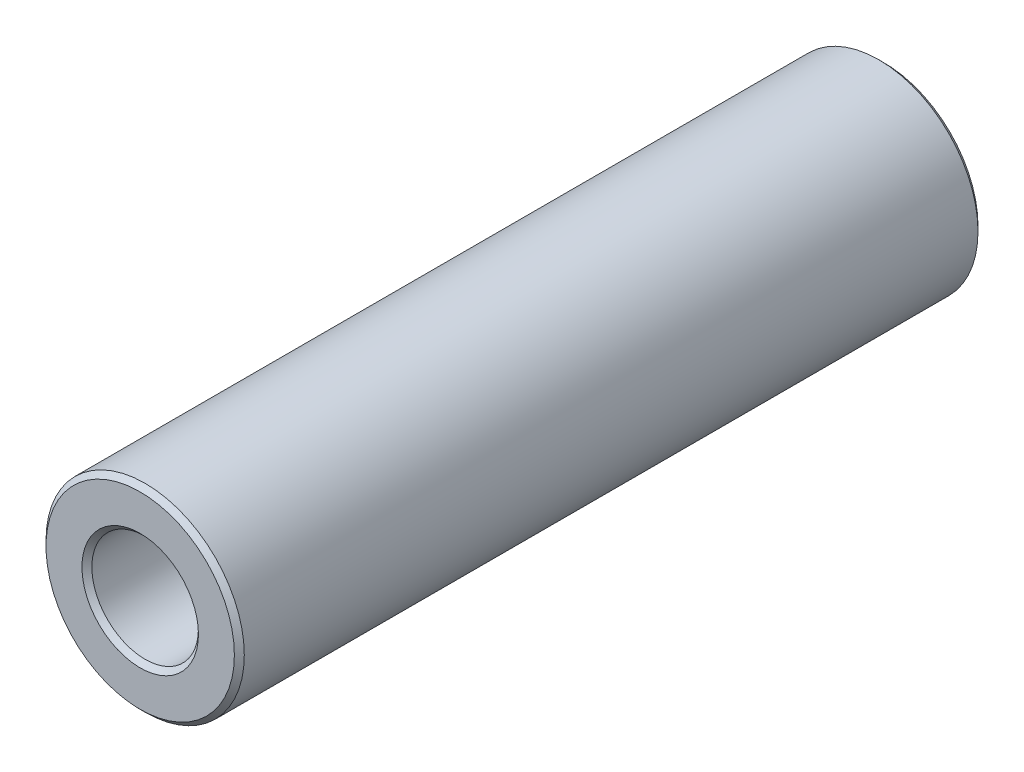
from build123d import *

# Parameters (mm, degrees)
SKETCH1_R           = 4
SKETCH1_R_2         = 2.15
BOSS_EXTRUDE2_DEPTH = 15
CHAMFER3_SIZE       = 0.2


with BuildPart() as part:
    # Sketch1 → Boss-Extrude2 (new, symmetric)
    with BuildSketch(Plane.XY):
        Circle(SKETCH1_R)
        Circle(SKETCH1_R_2, mode=Mode.SUBTRACT)
    extrude(amount=BOSS_EXTRUDE2_DEPTH, both=True)

    # Chamfer3
    chamfer3_edges = [part.edges().sort_by_distance(p)[0] for p in [
        (-4, 0, -15),
        (-4, 0, 15),
        (-2.15, 0, -15),
        (-2.15, 0, 15),
    ]]
    chamfer(chamfer3_edges, length=CHAMFER3_SIZE)


solid = part.part
